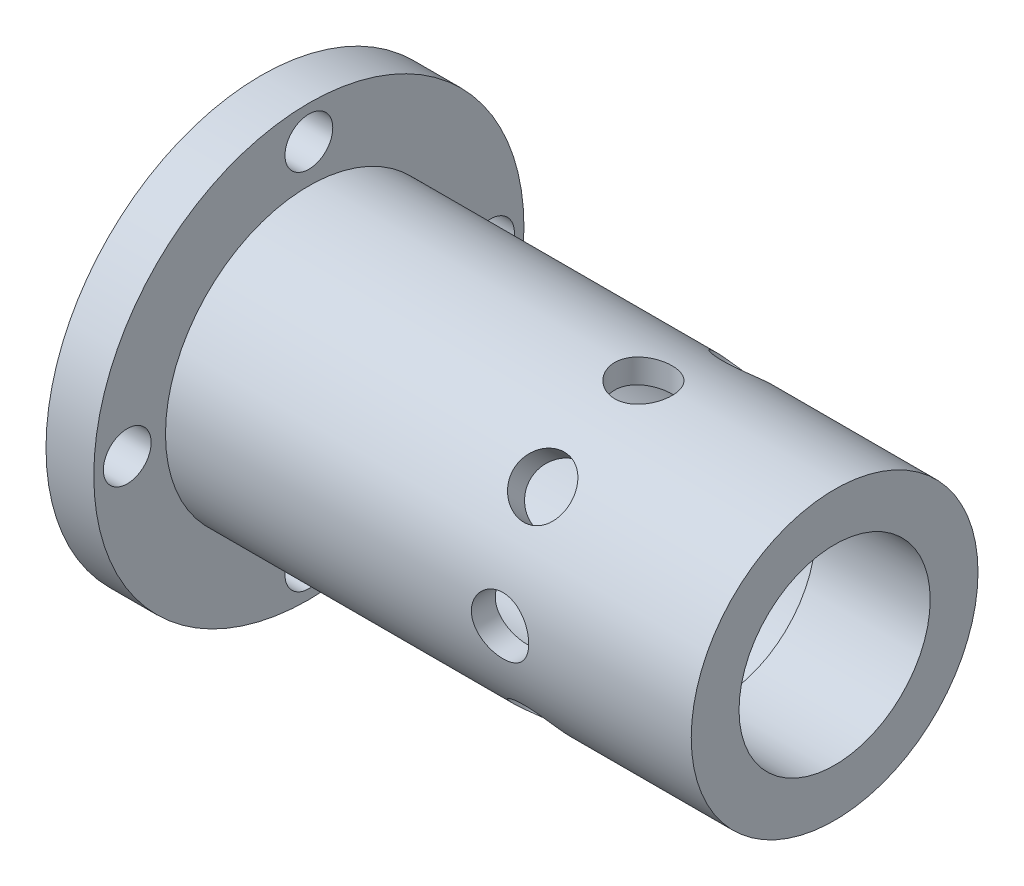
from build123d import *

# Parameters (mm, degrees)
ESQUISSE2_R                  = 10
ENL_V_MAT_EXTRU_1_DEPTH      = 12
ESQUISSE3_R                  = 12.5
ENL_V_MAT_EXTRU_2_DEPTH      = 48
ENL_V_MAT_EXTRU_3_REACH      = 69.915
ENL_V_MAT_EXTRU_3_END_RADIUS = 15
ESQUISSE4_R                  = 3
R_P_TITION_CIRCULAIRE1_COUNT = 8
ESQUISSE5_R                  = 2.5
ENL_V_MAT_EXTRU_4_DEPTH      = 48
R_P_TITION_CIRCULAIRE2_COUNT = 4


with BuildPart() as part:
    # Esquisse1 → R_volution1 (revolve)
    with BuildSketch(Plane.XY, mode=Mode.PRIVATE) as r_volution1_sk:
        Polygon((0, 0), (0, 22.5), (5, 22.5), (5, 15), (60, 15), (60, 0), align=None)
    revolve(r_volution1_sk.sketch.rotate(Axis((-15.805496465, 0, 0), (1, 0, 0)), 90), axis=Axis((-15.805496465, 0, 0), (1, 0, 0)))

    # Esquisse2 → Enl_v. mat.-Extru.1 (cut)
    with BuildSketch(Plane(origin=(60, 0, 0), x_dir=(0, 0, -1), z_dir=(1, 0, 0))):
        Circle(ESQUISSE2_R)
    extrude(amount=-ENL_V_MAT_EXTRU_1_DEPTH, mode=Mode.SUBTRACT)

    # Esquisse3 → Enl_v. mat.-Extru.2 (cut)
    with BuildSketch(Plane.ZY):
        Circle(ESQUISSE3_R)
    extrude(amount=-ENL_V_MAT_EXTRU_2_DEPTH, mode=Mode.SUBTRACT)

    # Enl_v. mat.-Extru.3: up to this cylinder (the profile starts inside it)
    enl_v_mat_extru_3_end = Plane(origin=(40, 0, 0), z_dir=(-1, 0, 0)) * Cylinder(ENL_V_MAT_EXTRU_3_END_RADIUS, 170.83, mode=Mode.PRIVATE)
    # Esquisse4 → Enl_v. mat.-Extru.3 (cut, up to the surface)
    with BuildSketch(Plane.XY, mode=Mode.PRIVATE) as enl_v_mat_extru_3_sk1:
        with Locations((40, 0)):
            Circle(ESQUISSE4_R)
    enl_v_mat_extru_3_tool1 = extrude(enl_v_mat_extru_3_sk1.sketch, amount=-ENL_V_MAT_EXTRU_3_REACH, mode=Mode.PRIVATE) & enl_v_mat_extru_3_end
    enl_v_mat_extru_3 = enl_v_mat_extru_3_tool1.solids().sort_by_distance((40, 0, 0))[0]
    add(enl_v_mat_extru_3, mode=Mode.SUBTRACT)

    # R_p_tition circulaire1: Enl_v. mat.-Extru.3 ×8 about axis
    r_p_tition_circulaire1_axis = Axis((48, 0, 0), (1, 0, 0))
    for i in range(1, R_P_TITION_CIRCULAIRE1_COUNT):
        add(enl_v_mat_extru_3.rotate(r_p_tition_circulaire1_axis, i * 360 / R_P_TITION_CIRCULAIRE1_COUNT), mode=Mode.SUBTRACT)

    # Esquisse5 → Enl_v. mat.-Extru.4 (cut)
    with BuildSketch(Plane(origin=(5, 0, 0), x_dir=(0, 0, -1), z_dir=(1, 0, 0))):
        with Locations((0, 19)):
            Circle(ESQUISSE5_R)
    enl_v_mat_extru_4 = extrude(amount=-ENL_V_MAT_EXTRU_4_DEPTH, mode=Mode.SUBTRACT)

    # R_p_tition circulaire2: Enl_v. mat.-Extru.4 ×4 about axis
    r_p_tition_circulaire2_axis = Axis((0, 0, 0), (1, 0, 0))
    for i in range(1, R_P_TITION_CIRCULAIRE2_COUNT):
        add(enl_v_mat_extru_4.rotate(r_p_tition_circulaire2_axis, i * 360 / R_P_TITION_CIRCULAIRE2_COUNT), mode=Mode.SUBTRACT)


solid = part.part
